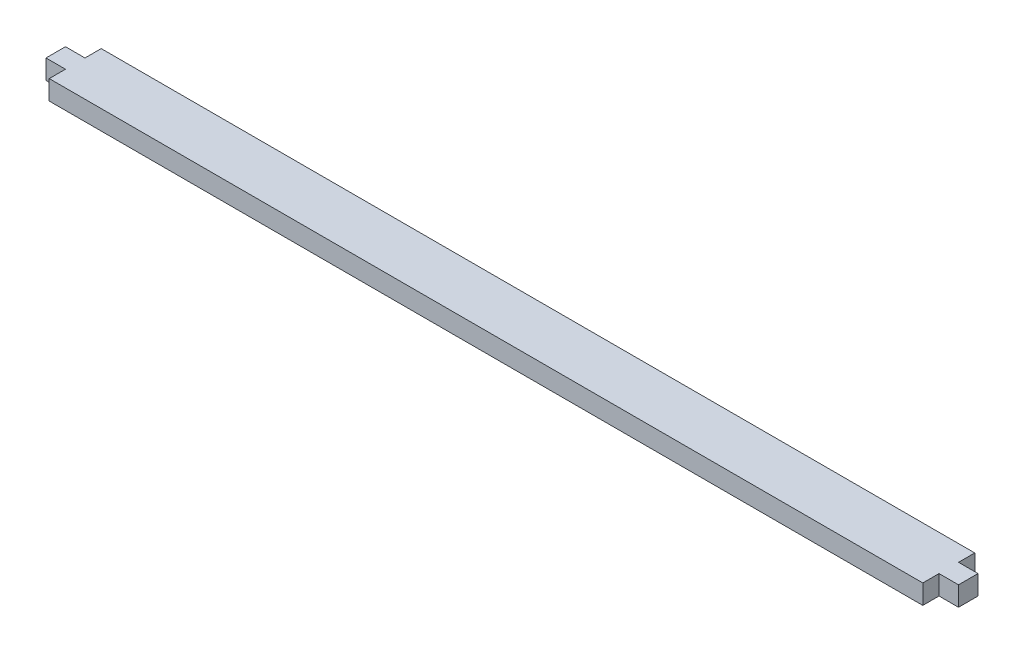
from build123d import *

# Parameters (mm, degrees)
SKETCH1_W           = 140.5
SKETCH1_H           = 8
BOSS_EXTRUDE1_DEPTH = 3
SKETCH2_W           = 3
SKETCH2_H           = 2.5
CUT_EXTRUDE1_DEPTH  = 3


with BuildPart() as part:
    # Sketch1 → Boss-Extrude1 (new body)
    with BuildSketch(Plane(origin=(0, 0, 0), x_dir=(1, 0, 0), z_dir=(0, 1, 0))):
        Rectangle(SKETCH1_W, SKETCH1_H)
    extrude(amount=BOSS_EXTRUDE1_DEPTH)

    # Sketch2 → Cut-Extrude1 (cut)
    with BuildSketch(Plane(origin=(0, 0, 0), x_dir=(1, 0, 0), z_dir=(0, 1, 0))):
        with Locations((-68.75, 2.75)):
            Rectangle(SKETCH2_W, SKETCH2_H)
        with Locations((-68.75, -2.75)):
            Rectangle(SKETCH2_W, SKETCH2_H)
        with Locations((68.75, -2.75)):
            Rectangle(SKETCH2_W, SKETCH2_H)
        with Locations((68.75, 2.75)):
            Rectangle(SKETCH2_W, SKETCH2_H)
    extrude(amount=CUT_EXTRUDE1_DEPTH, mode=Mode.SUBTRACT)


solid = part.part
